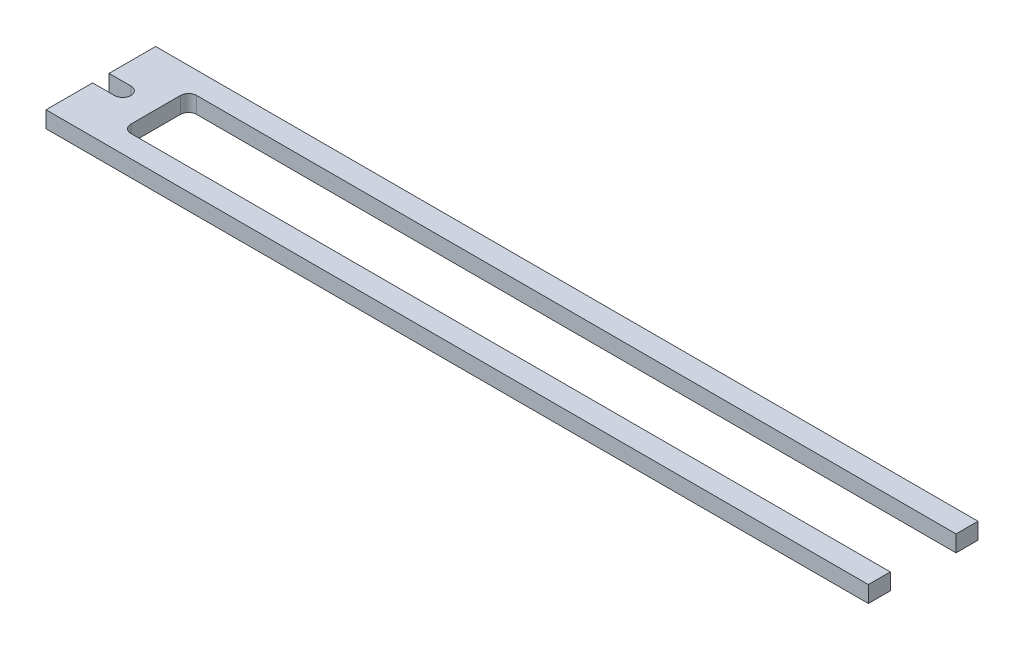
from build123d import *

# Parameters (mm, degrees)
EXTRUDE_1_DEPTH = 1.5


with BuildPart() as part:
    # Sketch 1 → Extrude 1 (new body)
    with BuildSketch(Plane(origin=(0, 0, 0), x_dir=(1, 0, 0), z_dir=(0, 1, 0))):
        with BuildLine():
            Line((51.98572087, 3.75), (-17.27427913, 3.75))
            ThreePointArc((-17.27427913, 3.75), (-17.797538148, 3.533259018), (-18.01427913, 3.01))
            Line((-18.01427913, 3.01), (-18.01427913, -1.51))
            ThreePointArc((-18.01427913, -1.51), (-17.797538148, -2.033259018), (-17.27427913, -2.25))
            Line((-17.27427913, -2.25), (51.98572087, -2.25))
            Line((51.98572087, -2.25), (51.98572087, -4.25))
            Line((51.98572087, -4.25), (-23.01427913, -4.25))
            Line((-23.01427913, -4.25), (-23.01427913, 0))
            Line((-23.01427913, 0), (-21.01427913, 0))
            ThreePointArc((-21.01427913, 0), (-20.26427913, 0.75), (-21.01427913, 1.5))
            Line((-21.01427913, 1.5), (-23.01427913, 1.5))
            Line((-23.01427913, 1.5), (-23.01427913, 5.75))
            Line((-23.01427913, 5.75), (51.98572087, 5.75))
            Line((51.98572087, 5.75), (51.98572087, 3.75))
        make_face()
    extrude(amount=EXTRUDE_1_DEPTH)


solid = part.part
